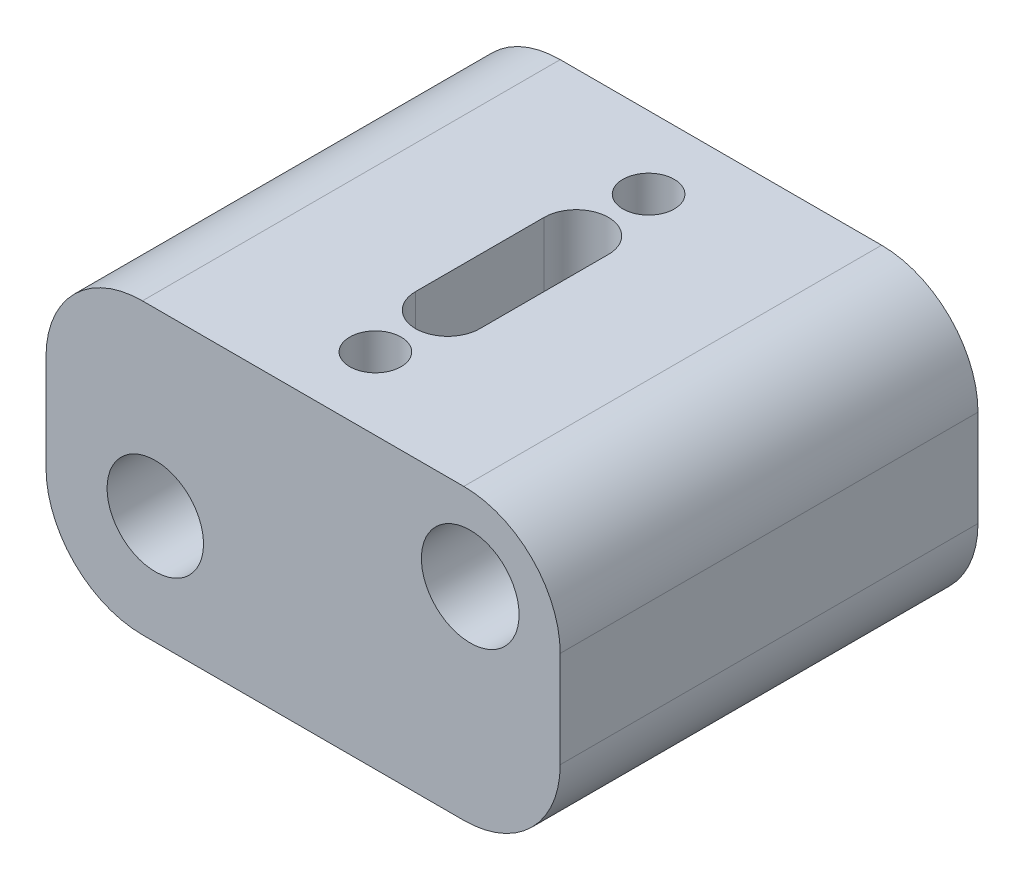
ISO-10303-21;
HEADER;
FILE_DESCRIPTION(('STEP AP214'),'2;1');
FILE_NAME('part.step','',(''),(''),'','','');
FILE_SCHEMA(('AUTOMOTIVE_DESIGN { 1 0 10303 214 1 1 1 1 }'));
ENDSEC;
DATA;
#1=APPLICATION_CONTEXT('core data for automotive mechanical design processes');
#2=APPLICATION_PROTOCOL_DEFINITION('international standard','automotive_design',2000,#1);
#3=PRODUCT_CONTEXT('',#1,'mechanical');
#4=PRODUCT('Part','Part','',(#3));
#5=PRODUCT_RELATED_PRODUCT_CATEGORY('part','',(#4));
#6=PRODUCT_DEFINITION_FORMATION('','',#4);
#7=PRODUCT_DEFINITION_CONTEXT('part definition',#1,'design');
#8=PRODUCT_DEFINITION('design','',#6,#7);
#9=PRODUCT_DEFINITION_SHAPE('','',#8);
#10=(LENGTH_UNIT() NAMED_UNIT(*) SI_UNIT(.MILLI.,.METRE.));
#11=(NAMED_UNIT(*) PLANE_ANGLE_UNIT() SI_UNIT($,.RADIAN.));
#12=(NAMED_UNIT(*) SI_UNIT($,.STERADIAN.) SOLID_ANGLE_UNIT());
#13=UNCERTAINTY_MEASURE_WITH_UNIT(LENGTH_MEASURE(1.E-05),#10,'distance_accuracy_value','');
#14=(GEOMETRIC_REPRESENTATION_CONTEXT(3) GLOBAL_UNCERTAINTY_ASSIGNED_CONTEXT((#13)) GLOBAL_UNIT_ASSIGNED_CONTEXT((#10,
#11,#12)) REPRESENTATION_CONTEXT('',''));
#15=CARTESIAN_POINT('',(0.,0.,0.));
#16=DIRECTION('',(0.,0.,1.));
#17=DIRECTION('',(1.,0.,0.));
#18=AXIS2_PLACEMENT_3D('',#15,#16,#17);
#19=CARTESIAN_POINT('',(-13.3112851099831,31.7508460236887,65.));
#20=DIRECTION('',(0.,0.,-1.));
#21=DIRECTION('',(-1.,0.,0.));
#22=AXIS2_PLACEMENT_3D('',#19,#20,#21);
#23=CYLINDRICAL_SURFACE('',#22,5.5);
#24=CARTESIAN_POINT('',(-13.3112851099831,31.7508460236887,0.));
#25=DIRECTION('',(0.,0.,-1.));
#26=DIRECTION('',(-1.,0.,0.));
#27=AXIS2_PLACEMENT_3D('',#24,#25,#26);
#28=CIRCLE('',#27,5.5);
#29=CARTESIAN_POINT('',(-18.8112851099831,31.7508460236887,0.));
#30=VERTEX_POINT('',#29);
#31=EDGE_CURVE('E370',#30,#30,#28,.T.);
#32=ORIENTED_EDGE('',*,*,#31,.T.);
#33=EDGE_LOOP('',(#32));
#34=FACE_BOUND('',#33,.T.);
#35=CARTESIAN_POINT('',(-13.3112851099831,31.7508460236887,35.));
#36=DIRECTION('',(0.,0.,1.));
#37=DIRECTION('',(1.,0.,0.));
#38=AXIS2_PLACEMENT_3D('',#35,#36,#37);
#39=CIRCLE('',#38,5.5);
#40=CARTESIAN_POINT('',(-7.81128510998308,31.7508460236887,35.));
#41=VERTEX_POINT('',#40);
#42=EDGE_CURVE('E364',#41,#41,#39,.F.);
#43=ORIENTED_EDGE('',*,*,#42,.F.);
#44=EDGE_LOOP('',(#43));
#45=FACE_BOUND('',#44,.T.);
#46=ADVANCED_FACE('F224',(#34,#45),#23,.F.);
#47=CARTESIAN_POINT('',(-79.3112851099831,44.7508460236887,65.));
#48=DIRECTION('',(1.,0.,0.));
#49=DIRECTION('',(0.,0.,-1.));
#50=AXIS2_PLACEMENT_3D('',#47,#48,#49);
#51=PLANE('',#50);
#52=DIRECTION('',(0.,-1.,0.));
#53=VECTOR('',#52,1.);
#54=CARTESIAN_POINT('',(-79.3112851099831,44.7508460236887,0.));
#55=LINE('',#54,#53);
#56=CARTESIAN_POINT('',(-79.3112851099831,29.7508460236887,0.));
#57=VERTEX_POINT('',#56);
#58=CARTESIAN_POINT('',(-79.3112851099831,14.7508460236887,0.));
#59=VERTEX_POINT('',#58);
#60=EDGE_CURVE('E377',#57,#59,#55,.T.);
#61=ORIENTED_EDGE('',*,*,#60,.T.);
#62=DIRECTION('',(0.,0.,-1.));
#63=VECTOR('',#62,1.);
#64=CARTESIAN_POINT('',(-79.3112851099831,14.7508460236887,65.));
#65=LINE('',#64,#63);
#66=CARTESIAN_POINT('',(-79.3112851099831,14.7508460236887,65.));
#67=VERTEX_POINT('',#66);
#68=EDGE_CURVE('E232',#59,#67,#65,.F.);
#69=ORIENTED_EDGE('',*,*,#68,.T.);
#70=DIRECTION('',(0.,-1.,0.));
#71=VECTOR('',#70,1.);
#72=CARTESIAN_POINT('',(-79.3112851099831,44.7508460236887,65.));
#73=LINE('',#72,#71);
#74=CARTESIAN_POINT('',(-79.3112851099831,29.7508460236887,65.));
#75=VERTEX_POINT('',#74);
#76=EDGE_CURVE('E380',#75,#67,#73,.T.);
#77=ORIENTED_EDGE('',*,*,#76,.F.);
#78=DIRECTION('',(0.,0.,-1.));
#79=VECTOR('',#78,1.);
#80=CARTESIAN_POINT('',(-79.3112851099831,29.7508460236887,65.));
#81=LINE('',#80,#79);
#82=EDGE_CURVE('E426',#75,#57,#81,.T.);
#83=ORIENTED_EDGE('',*,*,#82,.T.);
#84=EDGE_LOOP('',(#61,#69,#77,#83));
#85=FACE_BOUND('',#84,.T.);
#86=ADVANCED_FACE('F442',(#85),#51,.F.);
#87=CARTESIAN_POINT('',(-79.3112851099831,-0.249153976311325,65.));
#88=DIRECTION('',(0.,1.,0.));
#89=DIRECTION('',(0.,0.,1.));
#90=AXIS2_PLACEMENT_3D('',#87,#88,#89);
#91=PLANE('',#90);
#92=DIRECTION('',(0.,0.,1.));
#93=VECTOR('',#92,1.);
#94=CARTESIAN_POINT('',(-44.3112851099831,-0.249153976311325,42.5));
#95=LINE('',#94,#93);
#96=CARTESIAN_POINT('',(-44.3112851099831,-0.249153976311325,22.5));
#97=VERTEX_POINT('',#96);
#98=CARTESIAN_POINT('',(-44.3112851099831,-0.249153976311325,42.5));
#99=VERTEX_POINT('',#98);
#100=EDGE_CURVE('E320',#97,#99,#95,.T.);
#101=ORIENTED_EDGE('',*,*,#100,.T.);
#102=CARTESIAN_POINT('',(-39.3112851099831,-0.249153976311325,42.5));
#103=DIRECTION('',(0.,1.,0.));
#104=DIRECTION('',(0.,0.,1.));
#105=AXIS2_PLACEMENT_3D('',#102,#103,#104);
#106=CIRCLE('',#105,5.);
#107=CARTESIAN_POINT('',(-34.3112851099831,-0.249153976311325,42.5));
#108=VERTEX_POINT('',#107);
#109=EDGE_CURVE('E314',#99,#108,#106,.T.);
#110=ORIENTED_EDGE('',*,*,#109,.T.);
#111=DIRECTION('',(0.,0.,-1.));
#112=VECTOR('',#111,1.);
#113=CARTESIAN_POINT('',(-34.3112851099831,-0.249153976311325,42.5));
#114=LINE('',#113,#112);
#115=CARTESIAN_POINT('',(-34.3112851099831,-0.249153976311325,22.5));
#116=VERTEX_POINT('',#115);
#117=EDGE_CURVE('E323',#108,#116,#114,.T.);
#118=ORIENTED_EDGE('',*,*,#117,.T.);
#119=CARTESIAN_POINT('',(-39.3112851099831,-0.249153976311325,22.5));
#120=DIRECTION('',(0.,1.,0.));
#121=DIRECTION('',(0.,0.,1.));
#122=AXIS2_PLACEMENT_3D('',#119,#120,#121);
#123=CIRCLE('',#122,5.);
#124=EDGE_CURVE('E239',#116,#97,#123,.T.);
#125=ORIENTED_EDGE('',*,*,#124,.T.);
#126=EDGE_LOOP('',(#101,#110,#118,#125));
#127=FACE_BOUND('',#126,.T.);
#128=CARTESIAN_POINT('',(-39.3112851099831,-0.249153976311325,11.25));
#129=DIRECTION('',(0.,-1.,0.));
#130=DIRECTION('',(0.,0.,-1.));
#131=AXIS2_PLACEMENT_3D('',#128,#129,#130);
#132=CIRCLE('',#131,4.00000000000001);
#133=CARTESIAN_POINT('',(-39.3112851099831,-0.249153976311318,7.24999999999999));
#134=VERTEX_POINT('',#133);
#135=EDGE_CURVE('E345',#134,#134,#132,.T.);
#136=ORIENTED_EDGE('',*,*,#135,.F.);
#137=EDGE_LOOP('',(#136));
#138=FACE_BOUND('',#137,.T.);
#139=CARTESIAN_POINT('',(-39.3112851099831,-0.249153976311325,53.75));
#140=DIRECTION('',(0.,-1.,0.));
#141=DIRECTION('',(0.,0.,-1.));
#142=AXIS2_PLACEMENT_3D('',#139,#140,#141);
#143=CIRCLE('',#142,4.00000000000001);
#144=CARTESIAN_POINT('',(-39.3112851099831,-0.249153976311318,49.75));
#145=VERTEX_POINT('',#144);
#146=EDGE_CURVE('E352',#145,#145,#143,.T.);
#147=ORIENTED_EDGE('',*,*,#146,.F.);
#148=EDGE_LOOP('',(#147));
#149=FACE_BOUND('',#148,.T.);
#150=DIRECTION('',(1.,0.,0.));
#151=VECTOR('',#150,1.);
#152=CARTESIAN_POINT('',(-79.3112851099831,-0.249153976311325,65.));
#153=LINE('',#152,#151);
#154=CARTESIAN_POINT('',(-64.3112851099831,-0.249153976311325,65.));
#155=VERTEX_POINT('',#154);
#156=CARTESIAN_POINT('',(-14.3112851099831,-0.249153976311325,65.));
#157=VERTEX_POINT('',#156);
#158=EDGE_CURVE('E383',#155,#157,#153,.T.);
#159=ORIENTED_EDGE('',*,*,#158,.F.);
#160=DIRECTION('',(0.,0.,-1.));
#161=VECTOR('',#160,1.);
#162=CARTESIAN_POINT('',(-64.3112851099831,-0.249153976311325,65.));
#163=LINE('',#162,#161);
#164=CARTESIAN_POINT('',(-64.3112851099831,-0.249153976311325,0.));
#165=VERTEX_POINT('',#164);
#166=EDGE_CURVE('E435',#155,#165,#163,.T.);
#167=ORIENTED_EDGE('',*,*,#166,.T.);
#168=DIRECTION('',(1.,0.,0.));
#169=VECTOR('',#168,1.);
#170=CARTESIAN_POINT('',(-79.3112851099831,-0.249153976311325,0.));
#171=LINE('',#170,#169);
#172=CARTESIAN_POINT('',(-14.3112851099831,-0.249153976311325,0.));
#173=VERTEX_POINT('',#172);
#174=EDGE_CURVE('E395',#165,#173,#171,.T.);
#175=ORIENTED_EDGE('',*,*,#174,.T.);
#176=DIRECTION('',(0.,0.,-1.));
#177=VECTOR('',#176,1.);
#178=CARTESIAN_POINT('',(-14.3112851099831,-0.249153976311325,65.));
#179=LINE('',#178,#177);
#180=EDGE_CURVE('E412',#173,#157,#179,.F.);
#181=ORIENTED_EDGE('',*,*,#180,.T.);
#182=EDGE_LOOP('',(#159,#167,#175,#181));
#183=FACE_BOUND('',#182,.T.);
#184=ADVANCED_FACE('F327',(#127,#138,#149,#183),#91,.F.);
#185=CARTESIAN_POINT('',(0.688714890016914,44.7508460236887,65.));
#186=DIRECTION('',(-1.,0.,0.));
#187=DIRECTION('',(0.,-1.,0.));
#188=AXIS2_PLACEMENT_3D('',#185,#186,#187);
#189=PLANE('',#188);
#190=DIRECTION('',(0.,1.,0.));
#191=VECTOR('',#190,1.);
#192=CARTESIAN_POINT('',(0.688714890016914,44.7508460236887,0.));
#193=LINE('',#192,#191);
#194=CARTESIAN_POINT('',(0.688714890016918,14.7508460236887,0.));
#195=VERTEX_POINT('',#194);
#196=CARTESIAN_POINT('',(0.688714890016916,29.7508460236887,0.));
#197=VERTEX_POINT('',#196);
#198=EDGE_CURVE('E397',#195,#197,#193,.T.);
#199=ORIENTED_EDGE('',*,*,#198,.T.);
#200=DIRECTION('',(0.,0.,-1.));
#201=VECTOR('',#200,1.);
#202=CARTESIAN_POINT('',(0.688714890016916,29.7508460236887,65.));
#203=LINE('',#202,#201);
#204=CARTESIAN_POINT('',(0.688714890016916,29.7508460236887,65.));
#205=VERTEX_POINT('',#204);
#206=EDGE_CURVE('E422',#197,#205,#203,.F.);
#207=ORIENTED_EDGE('',*,*,#206,.T.);
#208=DIRECTION('',(0.,1.,0.));
#209=VECTOR('',#208,1.);
#210=CARTESIAN_POINT('',(0.688714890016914,44.7508460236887,65.));
#211=LINE('',#210,#209);
#212=CARTESIAN_POINT('',(0.688714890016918,14.7508460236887,65.));
#213=VERTEX_POINT('',#212);
#214=EDGE_CURVE('E386',#213,#205,#211,.T.);
#215=ORIENTED_EDGE('',*,*,#214,.F.);
#216=DIRECTION('',(0.,0.,-1.));
#217=VECTOR('',#216,1.);
#218=CARTESIAN_POINT('',(0.688714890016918,14.7508460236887,65.));
#219=LINE('',#218,#217);
#220=EDGE_CURVE('E404',#213,#195,#219,.T.);
#221=ORIENTED_EDGE('',*,*,#220,.T.);
#222=EDGE_LOOP('',(#199,#207,#215,#221));
#223=FACE_BOUND('',#222,.T.);
#224=ADVANCED_FACE('F465',(#223),#189,.F.);
#225=CARTESIAN_POINT('',(-79.3112851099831,44.7508460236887,65.));
#226=DIRECTION('',(0.,-1.,0.));
#227=DIRECTION('',(0.,0.,-1.));
#228=AXIS2_PLACEMENT_3D('',#225,#226,#227);
#229=PLANE('',#228);
#230=DIRECTION('',(0.,0.,-1.));
#231=VECTOR('',#230,1.);
#232=CARTESIAN_POINT('',(-34.3112851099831,44.7508460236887,42.5));
#233=LINE('',#232,#231);
#234=CARTESIAN_POINT('',(-34.3112851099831,44.7508460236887,42.5));
#235=VERTEX_POINT('',#234);
#236=CARTESIAN_POINT('',(-34.3112851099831,44.7508460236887,22.5));
#237=VERTEX_POINT('',#236);
#238=EDGE_CURVE('E339',#235,#237,#233,.T.);
#239=ORIENTED_EDGE('',*,*,#238,.F.);
#240=CARTESIAN_POINT('',(-39.3112851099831,44.7508460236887,42.5));
#241=DIRECTION('',(0.,1.,0.));
#242=DIRECTION('',(0.,0.,1.));
#243=AXIS2_PLACEMENT_3D('',#240,#241,#242);
#244=CIRCLE('',#243,5.);
#245=CARTESIAN_POINT('',(-44.3112851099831,44.7508460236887,42.5));
#246=VERTEX_POINT('',#245);
#247=EDGE_CURVE('E247',#246,#235,#244,.T.);
#248=ORIENTED_EDGE('',*,*,#247,.F.);
#249=DIRECTION('',(0.,0.,1.));
#250=VECTOR('',#249,1.);
#251=CARTESIAN_POINT('',(-44.3112851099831,44.7508460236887,42.5));
#252=LINE('',#251,#250);
#253=CARTESIAN_POINT('',(-44.3112851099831,44.7508460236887,22.5));
#254=VERTEX_POINT('',#253);
#255=EDGE_CURVE('E330',#254,#246,#252,.T.);
#256=ORIENTED_EDGE('',*,*,#255,.F.);
#257=CARTESIAN_POINT('',(-39.3112851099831,44.7508460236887,22.5));
#258=DIRECTION('',(0.,1.,0.));
#259=DIRECTION('',(0.,0.,1.));
#260=AXIS2_PLACEMENT_3D('',#257,#258,#259);
#261=CIRCLE('',#260,5.);
#262=EDGE_CURVE('E333',#237,#254,#261,.T.);
#263=ORIENTED_EDGE('',*,*,#262,.F.);
#264=EDGE_LOOP('',(#239,#248,#256,#263));
#265=FACE_BOUND('',#264,.T.);
#266=CARTESIAN_POINT('',(-39.3112851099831,44.7508460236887,11.25));
#267=DIRECTION('',(0.,-1.,0.));
#268=DIRECTION('',(0.,0.,-1.));
#269=AXIS2_PLACEMENT_3D('',#266,#267,#268);
#270=CIRCLE('',#269,4.00000000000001);
#271=CARTESIAN_POINT('',(-39.3112851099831,44.7508460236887,7.24999999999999));
#272=VERTEX_POINT('',#271);
#273=EDGE_CURVE('E349',#272,#272,#270,.T.);
#274=ORIENTED_EDGE('',*,*,#273,.T.);
#275=EDGE_LOOP('',(#274));
#276=FACE_BOUND('',#275,.T.);
#277=CARTESIAN_POINT('',(-39.3112851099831,44.7508460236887,53.75));
#278=DIRECTION('',(0.,-1.,0.));
#279=DIRECTION('',(0.,0.,-1.));
#280=AXIS2_PLACEMENT_3D('',#277,#278,#279);
#281=CIRCLE('',#280,4.00000000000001);
#282=CARTESIAN_POINT('',(-39.3112851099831,44.7508460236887,49.75));
#283=VERTEX_POINT('',#282);
#284=EDGE_CURVE('E355',#283,#283,#281,.T.);
#285=ORIENTED_EDGE('',*,*,#284,.T.);
#286=EDGE_LOOP('',(#285));
#287=FACE_BOUND('',#286,.T.);
#288=DIRECTION('',(-1.,0.,0.));
#289=VECTOR('',#288,1.);
#290=CARTESIAN_POINT('',(-79.3112851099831,44.7508460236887,0.));
#291=LINE('',#290,#289);
#292=CARTESIAN_POINT('',(-14.3112851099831,44.7508460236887,0.));
#293=VERTEX_POINT('',#292);
#294=CARTESIAN_POINT('',(-64.3112851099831,44.7508460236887,0.));
#295=VERTEX_POINT('',#294);
#296=EDGE_CURVE('E384',#293,#295,#291,.T.);
#297=ORIENTED_EDGE('',*,*,#296,.T.);
#298=DIRECTION('',(0.,0.,-1.));
#299=VECTOR('',#298,1.);
#300=CARTESIAN_POINT('',(-64.3112851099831,44.7508460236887,65.));
#301=LINE('',#300,#299);
#302=CARTESIAN_POINT('',(-64.3112851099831,44.7508460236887,65.));
#303=VERTEX_POINT('',#302);
#304=EDGE_CURVE('E431',#295,#303,#301,.F.);
#305=ORIENTED_EDGE('',*,*,#304,.T.);
#306=DIRECTION('',(-1.,0.,0.));
#307=VECTOR('',#306,1.);
#308=CARTESIAN_POINT('',(-79.3112851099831,44.7508460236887,65.));
#309=LINE('',#308,#307);
#310=CARTESIAN_POINT('',(-14.3112851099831,44.7508460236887,65.));
#311=VERTEX_POINT('',#310);
#312=EDGE_CURVE('E389',#311,#303,#309,.T.);
#313=ORIENTED_EDGE('',*,*,#312,.F.);
#314=DIRECTION('',(0.,0.,-1.));
#315=VECTOR('',#314,1.);
#316=CARTESIAN_POINT('',(-14.3112851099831,44.7508460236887,65.));
#317=LINE('',#316,#315);
#318=EDGE_CURVE('E417',#311,#293,#317,.T.);
#319=ORIENTED_EDGE('',*,*,#318,.T.);
#320=EDGE_LOOP('',(#297,#305,#313,#319));
#321=FACE_BOUND('',#320,.T.);
#322=ADVANCED_FACE('F472',(#265,#276,#287,#321),#229,.F.);
#323=CARTESIAN_POINT('',(0.,0.,65.));
#324=DIRECTION('',(0.,0.,1.));
#325=DIRECTION('',(1.,0.,0.));
#326=AXIS2_PLACEMENT_3D('',#323,#324,#325);
#327=PLANE('',#326);
#328=CARTESIAN_POINT('',(-13.3112851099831,31.7508460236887,65.));
#329=DIRECTION('',(0.,0.,1.));
#330=DIRECTION('',(1.,0.,0.));
#331=AXIS2_PLACEMENT_3D('',#328,#329,#330);
#332=CIRCLE('',#331,7.6);
#333=CARTESIAN_POINT('',(-5.71128510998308,31.7508460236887,65.));
#334=VERTEX_POINT('',#333);
#335=EDGE_CURVE('E358',#334,#334,#332,.T.);
#336=ORIENTED_EDGE('',*,*,#335,.F.);
#337=EDGE_LOOP('',(#336));
#338=FACE_BOUND('',#337,.T.);
#339=CARTESIAN_POINT('',(-62.3112851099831,16.7508460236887,65.));
#340=DIRECTION('',(0.,0.,-1.));
#341=DIRECTION('',(-1.,0.,0.));
#342=AXIS2_PLACEMENT_3D('',#339,#340,#341);
#343=CIRCLE('',#342,7.5);
#344=CARTESIAN_POINT('',(-69.8112851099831,16.7508460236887,65.));
#345=VERTEX_POINT('',#344);
#346=EDGE_CURVE('E367',#345,#345,#343,.T.);
#347=ORIENTED_EDGE('',*,*,#346,.T.);
#348=EDGE_LOOP('',(#347));
#349=FACE_BOUND('',#348,.T.);
#350=ORIENTED_EDGE('',*,*,#76,.T.);
#351=CARTESIAN_POINT('',(-64.3112851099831,14.7508460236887,65.));
#352=DIRECTION('',(0.,0.,1.));
#353=DIRECTION('',(1.,0.,0.));
#354=AXIS2_PLACEMENT_3D('',#351,#352,#353);
#355=CIRCLE('',#354,15.);
#356=EDGE_CURVE('E12',#67,#155,#355,.T.);
#357=ORIENTED_EDGE('',*,*,#356,.T.);
#358=ORIENTED_EDGE('',*,*,#158,.T.);
#359=CARTESIAN_POINT('',(-14.3112851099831,14.7508460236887,65.));
#360=DIRECTION('',(0.,0.,1.));
#361=DIRECTION('',(1.,0.,0.));
#362=AXIS2_PLACEMENT_3D('',#359,#360,#361);
#363=CIRCLE('',#362,15.);
#364=EDGE_CURVE('E415',#157,#213,#363,.T.);
#365=ORIENTED_EDGE('',*,*,#364,.T.);
#366=ORIENTED_EDGE('',*,*,#214,.T.);
#367=CARTESIAN_POINT('',(-14.3112851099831,29.7508460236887,65.));
#368=DIRECTION('',(0.,0.,1.));
#369=DIRECTION('',(1.,0.,0.));
#370=AXIS2_PLACEMENT_3D('',#367,#368,#369);
#371=CIRCLE('',#370,15.);
#372=EDGE_CURVE('E424',#205,#311,#371,.T.);
#373=ORIENTED_EDGE('',*,*,#372,.T.);
#374=ORIENTED_EDGE('',*,*,#312,.T.);
#375=CARTESIAN_POINT('',(-64.3112851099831,29.7508460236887,65.));
#376=DIRECTION('',(0.,0.,1.));
#377=DIRECTION('',(1.,0.,0.));
#378=AXIS2_PLACEMENT_3D('',#375,#376,#377);
#379=CIRCLE('',#378,15.);
#380=EDGE_CURVE('E433',#303,#75,#379,.T.);
#381=ORIENTED_EDGE('',*,*,#380,.T.);
#382=EDGE_LOOP('',(#350,#357,#358,#365,#366,#373,#374,#381));
#383=FACE_BOUND('',#382,.T.);
#384=ADVANCED_FACE('F448',(#338,#349,#383),#327,.T.);
#385=CARTESIAN_POINT('',(0.,0.,0.));
#386=DIRECTION('',(0.,0.,1.));
#387=DIRECTION('',(1.,0.,0.));
#388=AXIS2_PLACEMENT_3D('',#385,#386,#387);
#389=PLANE('',#388);
#390=ORIENTED_EDGE('',*,*,#31,.F.);
#391=EDGE_LOOP('',(#390));
#392=FACE_BOUND('',#391,.T.);
#393=CARTESIAN_POINT('',(-62.3112851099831,16.7508460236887,0.));
#394=DIRECTION('',(0.,0.,-1.));
#395=DIRECTION('',(-1.,0.,0.));
#396=AXIS2_PLACEMENT_3D('',#393,#394,#395);
#397=CIRCLE('',#396,12.8);
#398=CARTESIAN_POINT('',(-75.1112851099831,16.7508460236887,0.));
#399=VERTEX_POINT('',#398);
#400=EDGE_CURVE('E373',#399,#399,#397,.T.);
#401=ORIENTED_EDGE('',*,*,#400,.F.);
#402=EDGE_LOOP('',(#401));
#403=FACE_BOUND('',#402,.T.);
#404=ORIENTED_EDGE('',*,*,#174,.F.);
#405=CARTESIAN_POINT('',(-64.3112851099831,14.7508460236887,0.));
#406=DIRECTION('',(0.,0.,1.));
#407=DIRECTION('',(1.,0.,0.));
#408=AXIS2_PLACEMENT_3D('',#405,#406,#407);
#409=CIRCLE('',#408,15.);
#410=EDGE_CURVE('E438',#165,#59,#409,.F.);
#411=ORIENTED_EDGE('',*,*,#410,.T.);
#412=ORIENTED_EDGE('',*,*,#60,.F.);
#413=CARTESIAN_POINT('',(-64.3112851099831,29.7508460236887,0.));
#414=DIRECTION('',(0.,0.,1.));
#415=DIRECTION('',(1.,0.,0.));
#416=AXIS2_PLACEMENT_3D('',#413,#414,#415);
#417=CIRCLE('',#416,15.);
#418=EDGE_CURVE('E429',#57,#295,#417,.F.);
#419=ORIENTED_EDGE('',*,*,#418,.T.);
#420=ORIENTED_EDGE('',*,*,#296,.F.);
#421=CARTESIAN_POINT('',(-14.3112851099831,29.7508460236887,0.));
#422=DIRECTION('',(0.,0.,1.));
#423=DIRECTION('',(1.,0.,0.));
#424=AXIS2_PLACEMENT_3D('',#421,#422,#423);
#425=CIRCLE('',#424,15.);
#426=EDGE_CURVE('E420',#293,#197,#425,.F.);
#427=ORIENTED_EDGE('',*,*,#426,.T.);
#428=ORIENTED_EDGE('',*,*,#198,.F.);
#429=CARTESIAN_POINT('',(-14.3112851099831,14.7508460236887,0.));
#430=DIRECTION('',(0.,0.,1.));
#431=DIRECTION('',(1.,0.,0.));
#432=AXIS2_PLACEMENT_3D('',#429,#430,#431);
#433=CIRCLE('',#432,15.);
#434=EDGE_CURVE('E409',#195,#173,#433,.F.);
#435=ORIENTED_EDGE('',*,*,#434,.T.);
#436=EDGE_LOOP('',(#404,#411,#412,#419,#420,#427,#428,#435));
#437=FACE_BOUND('',#436,.T.);
#438=ADVANCED_FACE('F455',(#392,#403,#437),#389,.F.);
#439=CARTESIAN_POINT('',(-62.3112851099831,16.7508460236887,26.));
#440=DIRECTION('',(0.,0.,-1.));
#441=DIRECTION('',(-1.,0.,0.));
#442=AXIS2_PLACEMENT_3D('',#439,#440,#441);
#443=CYLINDRICAL_SURFACE('',#442,12.8);
#444=CARTESIAN_POINT('',(-62.3112851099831,16.7508460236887,26.));
#445=DIRECTION('',(0.,0.,-1.));
#446=DIRECTION('',(-1.,0.,0.));
#447=AXIS2_PLACEMENT_3D('',#444,#445,#446);
#448=CIRCLE('',#447,12.8);
#449=CARTESIAN_POINT('',(-75.1112851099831,16.7508460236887,26.));
#450=VERTEX_POINT('',#449);
#451=EDGE_CURVE('E374',#450,#450,#448,.T.);
#452=CARTESIAN_POINT('',(-75.1112851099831,16.7508460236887,26.));
#453=CARTESIAN_POINT('',(-75.1112851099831,16.7508460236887,25.7291666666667));
#454=CARTESIAN_POINT('',(-75.1112851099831,16.7508460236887,25.4583333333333));
#455=CARTESIAN_POINT('',(-75.1112851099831,16.7508460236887,24.9166666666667));
#456=CARTESIAN_POINT('',(-75.1112851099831,16.7508460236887,24.6458333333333));
#457=CARTESIAN_POINT('',(-75.1112851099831,16.7508460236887,24.1041666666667));
#458=CARTESIAN_POINT('',(-75.1112851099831,16.7508460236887,23.8333333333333));
#459=CARTESIAN_POINT('',(-75.1112851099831,16.7508460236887,23.2916666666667));
#460=CARTESIAN_POINT('',(-75.1112851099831,16.7508460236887,23.0208333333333));
#461=CARTESIAN_POINT('',(-75.1112851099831,16.7508460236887,22.4791666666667));
#462=CARTESIAN_POINT('',(-75.1112851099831,16.7508460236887,22.2083333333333));
#463=CARTESIAN_POINT('',(-75.1112851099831,16.7508460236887,21.6666666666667));
#464=CARTESIAN_POINT('',(-75.1112851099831,16.7508460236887,21.3958333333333));
#465=CARTESIAN_POINT('',(-75.1112851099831,16.7508460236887,20.8541666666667));
#466=CARTESIAN_POINT('',(-75.1112851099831,16.7508460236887,20.5833333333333));
#467=CARTESIAN_POINT('',(-75.1112851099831,16.7508460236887,20.0416666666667));
#468=CARTESIAN_POINT('',(-75.1112851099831,16.7508460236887,19.7708333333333));
#469=CARTESIAN_POINT('',(-75.1112851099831,16.7508460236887,19.2291666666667));
#470=CARTESIAN_POINT('',(-75.1112851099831,16.7508460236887,18.9583333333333));
#471=CARTESIAN_POINT('',(-75.1112851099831,16.7508460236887,18.4166666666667));
#472=CARTESIAN_POINT('',(-75.1112851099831,16.7508460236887,18.1458333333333));
#473=CARTESIAN_POINT('',(-75.1112851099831,16.7508460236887,17.6041666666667));
#474=CARTESIAN_POINT('',(-75.1112851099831,16.7508460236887,17.3333333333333));
#475=CARTESIAN_POINT('',(-75.1112851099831,16.7508460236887,16.7916666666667));
#476=CARTESIAN_POINT('',(-75.1112851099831,16.7508460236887,16.5208333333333));
#477=CARTESIAN_POINT('',(-75.1112851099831,16.7508460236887,15.9791666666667));
#478=CARTESIAN_POINT('',(-75.1112851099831,16.7508460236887,15.7083333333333));
#479=CARTESIAN_POINT('',(-75.1112851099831,16.7508460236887,15.1666666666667));
#480=CARTESIAN_POINT('',(-75.1112851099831,16.7508460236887,14.8958333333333));
#481=CARTESIAN_POINT('',(-75.1112851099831,16.7508460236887,14.3541666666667));
#482=CARTESIAN_POINT('',(-75.1112851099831,16.7508460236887,14.0833333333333));
#483=CARTESIAN_POINT('',(-75.1112851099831,16.7508460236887,13.5416666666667));
#484=CARTESIAN_POINT('',(-75.1112851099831,16.7508460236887,13.2708333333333));
#485=CARTESIAN_POINT('',(-75.1112851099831,16.7508460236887,12.7291666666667));
#486=CARTESIAN_POINT('',(-75.1112851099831,16.7508460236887,12.4583333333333));
#487=CARTESIAN_POINT('',(-75.1112851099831,16.7508460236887,11.9166666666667));
#488=CARTESIAN_POINT('',(-75.1112851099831,16.7508460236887,11.6458333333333));
#489=CARTESIAN_POINT('',(-75.1112851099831,16.7508460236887,11.1041666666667));
#490=CARTESIAN_POINT('',(-75.1112851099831,16.7508460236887,10.8333333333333));
#491=CARTESIAN_POINT('',(-75.1112851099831,16.7508460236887,10.2916666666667));
#492=CARTESIAN_POINT('',(-75.1112851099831,16.7508460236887,10.0208333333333));
#493=CARTESIAN_POINT('',(-75.1112851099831,16.7508460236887,9.47916666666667));
#494=CARTESIAN_POINT('',(-75.1112851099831,16.7508460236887,9.20833333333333));
#495=CARTESIAN_POINT('',(-75.1112851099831,16.7508460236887,8.66666666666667));
#496=CARTESIAN_POINT('',(-75.1112851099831,16.7508460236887,8.39583333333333));
#497=CARTESIAN_POINT('',(-75.1112851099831,16.7508460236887,7.85416666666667));
#498=CARTESIAN_POINT('',(-75.1112851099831,16.7508460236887,7.58333333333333));
#499=CARTESIAN_POINT('',(-75.1112851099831,16.7508460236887,7.04166666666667));
#500=CARTESIAN_POINT('',(-75.1112851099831,16.7508460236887,6.77083333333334));
#501=CARTESIAN_POINT('',(-75.1112851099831,16.7508460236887,6.22916666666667));
#502=CARTESIAN_POINT('',(-75.1112851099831,16.7508460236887,5.95833333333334));
#503=CARTESIAN_POINT('',(-75.1112851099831,16.7508460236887,5.41666666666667));
#504=CARTESIAN_POINT('',(-75.1112851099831,16.7508460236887,5.14583333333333));
#505=CARTESIAN_POINT('',(-75.1112851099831,16.7508460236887,4.60416666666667));
#506=CARTESIAN_POINT('',(-75.1112851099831,16.7508460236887,4.33333333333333));
#507=CARTESIAN_POINT('',(-75.1112851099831,16.7508460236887,3.79166666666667));
#508=CARTESIAN_POINT('',(-75.1112851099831,16.7508460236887,3.52083333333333));
#509=CARTESIAN_POINT('',(-75.1112851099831,16.7508460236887,2.97916666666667));
#510=CARTESIAN_POINT('',(-75.1112851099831,16.7508460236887,2.70833333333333));
#511=CARTESIAN_POINT('',(-75.1112851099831,16.7508460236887,2.16666666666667));
#512=CARTESIAN_POINT('',(-75.1112851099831,16.7508460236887,1.89583333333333));
#513=CARTESIAN_POINT('',(-75.1112851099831,16.7508460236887,1.35416666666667));
#514=CARTESIAN_POINT('',(-75.1112851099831,16.7508460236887,1.08333333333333));
#515=CARTESIAN_POINT('',(-75.1112851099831,16.7508460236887,0.541666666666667));
#516=CARTESIAN_POINT('',(-75.1112851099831,16.7508460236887,0.270833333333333));
#517=CARTESIAN_POINT('',(-75.1112851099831,16.7508460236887,0.));
#518=B_SPLINE_CURVE_WITH_KNOTS('',3,(#452,#453,#454,#455,#456,#457,#458,#459,#460,#461,#462,
#463,#464,#465,#466,#467,#468,#469,#470,#471,#472,#473,#474,#475,#476,#477,#478,#479,#480,#481,
#482,#483,#484,#485,#486,#487,#488,#489,#490,#491,#492,#493,#494,#495,#496,#497,#498,#499,#500,
#501,#502,#503,#504,#505,#506,#507,#508,#509,#510,#511,#512,#513,#514,#515,#516,#517),
.UNSPECIFIED.,.F.,.F.,(4,2,2,2,2,2,2,2,2,2,2,2,2,2,2,2,2,2,2,2,2,2,2,2,2,2,2,2,2,2,2,2,4),(0.,
0.812500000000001,1.625,2.4375,3.25,4.0625,4.875,5.6875,6.5,7.3125,8.125,8.9375,9.75,10.5625,
11.375,12.1875,13.,13.8125,14.625,15.4375,16.25,17.0625,17.875,18.6875,19.5,20.3125,21.125,
21.9375,22.75,23.5625,24.375,25.1875,26.),.UNSPECIFIED.);
#519=EDGE_CURVE('BSEAM495',#450,#399,#518,.T.);
#520=ORIENTED_EDGE('',*,*,#451,.F.);
#521=ORIENTED_EDGE('',*,*,#400,.T.);
#522=ORIENTED_EDGE('',*,*,#519,.T.);
#523=ORIENTED_EDGE('',*,*,#519,.F.);
#524=EDGE_LOOP('',(#520,#522,#521,#523));
#525=FACE_BOUND('',#524,.T.);
#526=ADVANCED_FACE('F495',(#525),#443,.F.);
#527=CARTESIAN_POINT('',(-62.3112851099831,16.7508460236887,65.));
#528=DIRECTION('',(0.,0.,-1.));
#529=DIRECTION('',(-1.,0.,0.));
#530=AXIS2_PLACEMENT_3D('',#527,#528,#529);
#531=CYLINDRICAL_SURFACE('',#530,7.5);
#532=CARTESIAN_POINT('',(-62.3112851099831,16.7508460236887,34.826664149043));
#533=DIRECTION('',(0.,0.,-1.));
#534=DIRECTION('',(-1.,0.,0.));
#535=AXIS2_PLACEMENT_3D('',#532,#533,#534);
#536=CIRCLE('',#535,7.5);
#537=CARTESIAN_POINT('',(-69.8112851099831,16.7508460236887,34.826664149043));
#538=VERTEX_POINT('',#537);
#539=EDGE_CURVE('E392',#538,#538,#536,.T.);
#540=ORIENTED_EDGE('',*,*,#539,.T.);
#541=EDGE_LOOP('',(#540));
#542=FACE_BOUND('',#541,.T.);
#543=ORIENTED_EDGE('',*,*,#346,.F.);
#544=EDGE_LOOP('',(#543));
#545=FACE_BOUND('',#544,.T.);
#546=ADVANCED_FACE('F493',(#542,#545),#531,.F.);
#547=CARTESIAN_POINT('',(-62.3112851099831,16.7508460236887,34.826664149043));
#548=DIRECTION('',(0.,0.,-1.));
#549=DIRECTION('',(-1.,0.,0.));
#550=AXIS2_PLACEMENT_3D('',#547,#548,#549);
#551=TOROIDAL_SURFACE('',#550,17.5,10.);
#552=ORIENTED_EDGE('',*,*,#451,.T.);
#553=EDGE_LOOP('',(#552));
#554=FACE_BOUND('',#553,.T.);
#555=ORIENTED_EDGE('',*,*,#539,.F.);
#556=EDGE_LOOP('',(#555));
#557=FACE_BOUND('',#556,.T.);
#558=ADVANCED_FACE('F512',(#554,#557),#551,.T.);
#559=CARTESIAN_POINT('',(-13.3112851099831,31.7508460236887,35.));
#560=DIRECTION('',(0.,0.,1.));
#561=DIRECTION('',(1.,0.,0.));
#562=AXIS2_PLACEMENT_3D('',#559,#560,#561);
#563=PLANE('',#562);
#564=CARTESIAN_POINT('',(-13.3112851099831,31.7508460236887,35.));
#565=DIRECTION('',(0.,0.,1.));
#566=DIRECTION('',(1.,0.,0.));
#567=AXIS2_PLACEMENT_3D('',#564,#565,#566);
#568=CIRCLE('',#567,7.6);
#569=CARTESIAN_POINT('',(-5.71128510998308,31.7508460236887,35.));
#570=VERTEX_POINT('',#569);
#571=EDGE_CURVE('E361',#570,#570,#568,.T.);
#572=ORIENTED_EDGE('',*,*,#571,.T.);
#573=EDGE_LOOP('',(#572));
#574=FACE_BOUND('',#573,.T.);
#575=ORIENTED_EDGE('',*,*,#42,.T.);
#576=EDGE_LOOP('',(#575));
#577=FACE_BOUND('',#576,.T.);
#578=ADVANCED_FACE('F515',(#574,#577),#563,.T.);
#579=CARTESIAN_POINT('',(-13.3112851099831,31.7508460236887,35.));
#580=DIRECTION('',(0.,0.,1.));
#581=DIRECTION('',(1.,0.,0.));
#582=AXIS2_PLACEMENT_3D('',#579,#580,#581);
#583=CYLINDRICAL_SURFACE('',#582,7.6);
#584=ORIENTED_EDGE('',*,*,#571,.F.);
#585=EDGE_LOOP('',(#584));
#586=FACE_BOUND('',#585,.T.);
#587=ORIENTED_EDGE('',*,*,#335,.T.);
#588=EDGE_LOOP('',(#587));
#589=FACE_BOUND('',#588,.T.);
#590=ADVANCED_FACE('F528',(#586,#589),#583,.F.);
#591=CARTESIAN_POINT('',(-39.3112851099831,44.7508460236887,53.75));
#592=DIRECTION('',(0.,-1.,0.));
#593=DIRECTION('',(0.,0.,-1.));
#594=AXIS2_PLACEMENT_3D('',#591,#592,#593);
#595=CYLINDRICAL_SURFACE('',#594,4.00000000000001);
#596=CARTESIAN_POINT('',(-39.3112851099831,44.7508460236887,49.75));
#597=CARTESIAN_POINT('',(-39.3112851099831,44.2820960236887,49.75));
#598=CARTESIAN_POINT('',(-39.3112851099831,43.8133460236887,49.75));
#599=CARTESIAN_POINT('',(-39.3112851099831,42.8758460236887,49.75));
#600=CARTESIAN_POINT('',(-39.3112851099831,42.4070960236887,49.75));
#601=CARTESIAN_POINT('',(-39.3112851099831,41.4695960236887,49.75));
#602=CARTESIAN_POINT('',(-39.3112851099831,41.0008460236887,49.75));
#603=CARTESIAN_POINT('',(-39.3112851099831,40.0633460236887,49.75));
#604=CARTESIAN_POINT('',(-39.3112851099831,39.5945960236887,49.75));
#605=CARTESIAN_POINT('',(-39.3112851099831,38.6570960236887,49.75));
#606=CARTESIAN_POINT('',(-39.3112851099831,38.1883460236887,49.75));
#607=CARTESIAN_POINT('',(-39.3112851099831,37.2508460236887,49.75));
#608=CARTESIAN_POINT('',(-39.3112851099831,36.7820960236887,49.75));
#609=CARTESIAN_POINT('',(-39.3112851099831,35.8445960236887,49.75));
#610=CARTESIAN_POINT('',(-39.3112851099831,35.3758460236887,49.75));
#611=CARTESIAN_POINT('',(-39.3112851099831,34.4383460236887,49.75));
#612=CARTESIAN_POINT('',(-39.3112851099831,33.9695960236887,49.75));
#613=CARTESIAN_POINT('',(-39.3112851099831,33.0320960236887,49.75));
#614=CARTESIAN_POINT('',(-39.3112851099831,32.5633460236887,49.75));
#615=CARTESIAN_POINT('',(-39.3112851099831,31.6258460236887,49.75));
#616=CARTESIAN_POINT('',(-39.3112851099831,31.1570960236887,49.75));
#617=CARTESIAN_POINT('',(-39.3112851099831,30.2195960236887,49.75));
#618=CARTESIAN_POINT('',(-39.3112851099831,29.7508460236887,49.75));
#619=CARTESIAN_POINT('',(-39.3112851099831,28.8133460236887,49.75));
#620=CARTESIAN_POINT('',(-39.3112851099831,28.3445960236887,49.75));
#621=CARTESIAN_POINT('',(-39.3112851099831,27.4070960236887,49.75));
#622=CARTESIAN_POINT('',(-39.3112851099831,26.9383460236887,49.75));
#623=CARTESIAN_POINT('',(-39.3112851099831,26.0008460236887,49.75));
#624=CARTESIAN_POINT('',(-39.3112851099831,25.5320960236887,49.75));
#625=CARTESIAN_POINT('',(-39.3112851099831,24.5945960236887,49.75));
#626=CARTESIAN_POINT('',(-39.3112851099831,24.1258460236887,49.75));
#627=CARTESIAN_POINT('',(-39.3112851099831,23.1883460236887,49.75));
#628=CARTESIAN_POINT('',(-39.3112851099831,22.7195960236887,49.75));
#629=CARTESIAN_POINT('',(-39.3112851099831,21.7820960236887,49.75));
#630=CARTESIAN_POINT('',(-39.3112851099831,21.3133460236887,49.75));
#631=CARTESIAN_POINT('',(-39.3112851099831,20.3758460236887,49.75));
#632=CARTESIAN_POINT('',(-39.3112851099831,19.9070960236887,49.75));
#633=CARTESIAN_POINT('',(-39.3112851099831,18.9695960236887,49.75));
#634=CARTESIAN_POINT('',(-39.3112851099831,18.5008460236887,49.75));
#635=CARTESIAN_POINT('',(-39.3112851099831,17.5633460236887,49.75));
#636=CARTESIAN_POINT('',(-39.3112851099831,17.0945960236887,49.75));
#637=CARTESIAN_POINT('',(-39.3112851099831,16.1570960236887,49.75));
#638=CARTESIAN_POINT('',(-39.3112851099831,15.6883460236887,49.75));
#639=CARTESIAN_POINT('',(-39.3112851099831,14.7508460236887,49.75));
#640=CARTESIAN_POINT('',(-39.3112851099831,14.2820960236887,49.75));
#641=CARTESIAN_POINT('',(-39.3112851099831,13.3445960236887,49.75));
#642=CARTESIAN_POINT('',(-39.3112851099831,12.8758460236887,49.75));
#643=CARTESIAN_POINT('',(-39.3112851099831,11.9383460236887,49.75));
#644=CARTESIAN_POINT('',(-39.3112851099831,11.4695960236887,49.75));
#645=CARTESIAN_POINT('',(-39.3112851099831,10.5320960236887,49.75));
#646=CARTESIAN_POINT('',(-39.3112851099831,10.0633460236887,49.75));
#647=CARTESIAN_POINT('',(-39.3112851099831,9.12584602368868,49.75));
#648=CARTESIAN_POINT('',(-39.3112851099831,8.65709602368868,49.75));
#649=CARTESIAN_POINT('',(-39.3112851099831,7.71959602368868,49.75));
#650=CARTESIAN_POINT('',(-39.3112851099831,7.25084602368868,49.75));
#651=CARTESIAN_POINT('',(-39.3112851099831,6.31334602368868,49.75));
#652=CARTESIAN_POINT('',(-39.3112851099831,5.84459602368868,49.75));
#653=CARTESIAN_POINT('',(-39.3112851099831,4.90709602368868,49.75));
#654=CARTESIAN_POINT('',(-39.3112851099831,4.43834602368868,49.75));
#655=CARTESIAN_POINT('',(-39.3112851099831,3.50084602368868,49.75));
#656=CARTESIAN_POINT('',(-39.3112851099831,3.03209602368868,49.75));
#657=CARTESIAN_POINT('',(-39.3112851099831,2.09459602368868,49.75));
#658=CARTESIAN_POINT('',(-39.3112851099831,1.62584602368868,49.75));
#659=CARTESIAN_POINT('',(-39.3112851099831,0.68834602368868,49.75));
#660=CARTESIAN_POINT('',(-39.3112851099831,0.219596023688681,49.75));
#661=CARTESIAN_POINT('',(-39.3112851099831,-0.249153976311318,49.75));
#662=B_SPLINE_CURVE_WITH_KNOTS('',3,(#596,#597,#598,#599,#600,#601,#602,#603,#604,#605,#606,
#607,#608,#609,#610,#611,#612,#613,#614,#615,#616,#617,#618,#619,#620,#621,#622,#623,#624,#625,
#626,#627,#628,#629,#630,#631,#632,#633,#634,#635,#636,#637,#638,#639,#640,#641,#642,#643,#644,
#645,#646,#647,#648,#649,#650,#651,#652,#653,#654,#655,#656,#657,#658,#659,#660,#661),
.UNSPECIFIED.,.F.,.F.,(4,2,2,2,2,2,2,2,2,2,2,2,2,2,2,2,2,2,2,2,2,2,2,2,2,2,2,2,2,2,2,2,4),(0.,
1.40625,2.8125,4.21874999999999,5.625,7.03125,8.43749999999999,9.84375,11.25,12.65625,14.0625,
15.46875,16.875,18.28125,19.6875,21.09375,22.5,23.90625,25.3125,26.71875,28.125,29.53125,
30.9375,32.34375,33.75,35.15625,36.5625,37.96875,39.375,40.78125,42.1875,43.59375,45.),.UNSPECIFIED.);
#663=EDGE_CURVE('BSEAM522',#283,#145,#662,.T.);
#664=ORIENTED_EDGE('',*,*,#284,.F.);
#665=ORIENTED_EDGE('',*,*,#146,.T.);
#666=ORIENTED_EDGE('',*,*,#663,.T.);
#667=ORIENTED_EDGE('',*,*,#663,.F.);
#668=EDGE_LOOP('',(#664,#666,#665,#667));
#669=FACE_BOUND('',#668,.T.);
#670=ADVANCED_FACE('F522',(#669),#595,.F.);
#671=CARTESIAN_POINT('',(-39.3112851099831,44.7508460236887,11.25));
#672=DIRECTION('',(0.,-1.,0.));
#673=DIRECTION('',(0.,0.,-1.));
#674=AXIS2_PLACEMENT_3D('',#671,#672,#673);
#675=CYLINDRICAL_SURFACE('',#674,4.00000000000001);
#676=CARTESIAN_POINT('',(-39.3112851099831,44.7508460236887,7.24999999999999));
#677=CARTESIAN_POINT('',(-39.3112851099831,44.2820960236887,7.24999999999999));
#678=CARTESIAN_POINT('',(-39.3112851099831,43.8133460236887,7.24999999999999));
#679=CARTESIAN_POINT('',(-39.3112851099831,42.8758460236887,7.24999999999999));
#680=CARTESIAN_POINT('',(-39.3112851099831,42.4070960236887,7.24999999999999));
#681=CARTESIAN_POINT('',(-39.3112851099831,41.4695960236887,7.24999999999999));
#682=CARTESIAN_POINT('',(-39.3112851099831,41.0008460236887,7.24999999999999));
#683=CARTESIAN_POINT('',(-39.3112851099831,40.0633460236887,7.24999999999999));
#684=CARTESIAN_POINT('',(-39.3112851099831,39.5945960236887,7.24999999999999));
#685=CARTESIAN_POINT('',(-39.3112851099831,38.6570960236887,7.24999999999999));
#686=CARTESIAN_POINT('',(-39.3112851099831,38.1883460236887,7.24999999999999));
#687=CARTESIAN_POINT('',(-39.3112851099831,37.2508460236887,7.24999999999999));
#688=CARTESIAN_POINT('',(-39.3112851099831,36.7820960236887,7.24999999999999));
#689=CARTESIAN_POINT('',(-39.3112851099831,35.8445960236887,7.24999999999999));
#690=CARTESIAN_POINT('',(-39.3112851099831,35.3758460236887,7.24999999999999));
#691=CARTESIAN_POINT('',(-39.3112851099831,34.4383460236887,7.24999999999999));
#692=CARTESIAN_POINT('',(-39.3112851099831,33.9695960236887,7.24999999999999));
#693=CARTESIAN_POINT('',(-39.3112851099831,33.0320960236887,7.24999999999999));
#694=CARTESIAN_POINT('',(-39.3112851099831,32.5633460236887,7.24999999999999));
#695=CARTESIAN_POINT('',(-39.3112851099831,31.6258460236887,7.24999999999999));
#696=CARTESIAN_POINT('',(-39.3112851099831,31.1570960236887,7.24999999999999));
#697=CARTESIAN_POINT('',(-39.3112851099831,30.2195960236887,7.24999999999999));
#698=CARTESIAN_POINT('',(-39.3112851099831,29.7508460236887,7.24999999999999));
#699=CARTESIAN_POINT('',(-39.3112851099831,28.8133460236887,7.24999999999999));
#700=CARTESIAN_POINT('',(-39.3112851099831,28.3445960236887,7.24999999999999));
#701=CARTESIAN_POINT('',(-39.3112851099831,27.4070960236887,7.24999999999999));
#702=CARTESIAN_POINT('',(-39.3112851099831,26.9383460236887,7.24999999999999));
#703=CARTESIAN_POINT('',(-39.3112851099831,26.0008460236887,7.24999999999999));
#704=CARTESIAN_POINT('',(-39.3112851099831,25.5320960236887,7.24999999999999));
#705=CARTESIAN_POINT('',(-39.3112851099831,24.5945960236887,7.24999999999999));
#706=CARTESIAN_POINT('',(-39.3112851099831,24.1258460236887,7.24999999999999));
#707=CARTESIAN_POINT('',(-39.3112851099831,23.1883460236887,7.24999999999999));
#708=CARTESIAN_POINT('',(-39.3112851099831,22.7195960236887,7.24999999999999));
#709=CARTESIAN_POINT('',(-39.3112851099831,21.7820960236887,7.24999999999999));
#710=CARTESIAN_POINT('',(-39.3112851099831,21.3133460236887,7.24999999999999));
#711=CARTESIAN_POINT('',(-39.3112851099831,20.3758460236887,7.24999999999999));
#712=CARTESIAN_POINT('',(-39.3112851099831,19.9070960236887,7.24999999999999));
#713=CARTESIAN_POINT('',(-39.3112851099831,18.9695960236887,7.24999999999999));
#714=CARTESIAN_POINT('',(-39.3112851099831,18.5008460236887,7.24999999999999));
#715=CARTESIAN_POINT('',(-39.3112851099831,17.5633460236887,7.24999999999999));
#716=CARTESIAN_POINT('',(-39.3112851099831,17.0945960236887,7.24999999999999));
#717=CARTESIAN_POINT('',(-39.3112851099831,16.1570960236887,7.24999999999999));
#718=CARTESIAN_POINT('',(-39.3112851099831,15.6883460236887,7.24999999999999));
#719=CARTESIAN_POINT('',(-39.3112851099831,14.7508460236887,7.24999999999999));
#720=CARTESIAN_POINT('',(-39.3112851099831,14.2820960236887,7.24999999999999));
#721=CARTESIAN_POINT('',(-39.3112851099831,13.3445960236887,7.24999999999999));
#722=CARTESIAN_POINT('',(-39.3112851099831,12.8758460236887,7.24999999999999));
#723=CARTESIAN_POINT('',(-39.3112851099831,11.9383460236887,7.24999999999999));
#724=CARTESIAN_POINT('',(-39.3112851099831,11.4695960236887,7.24999999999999));
#725=CARTESIAN_POINT('',(-39.3112851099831,10.5320960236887,7.24999999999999));
#726=CARTESIAN_POINT('',(-39.3112851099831,10.0633460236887,7.24999999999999));
#727=CARTESIAN_POINT('',(-39.3112851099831,9.12584602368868,7.24999999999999));
#728=CARTESIAN_POINT('',(-39.3112851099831,8.65709602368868,7.24999999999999));
#729=CARTESIAN_POINT('',(-39.3112851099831,7.71959602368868,7.24999999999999));
#730=CARTESIAN_POINT('',(-39.3112851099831,7.25084602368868,7.24999999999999));
#731=CARTESIAN_POINT('',(-39.3112851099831,6.31334602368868,7.24999999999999));
#732=CARTESIAN_POINT('',(-39.3112851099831,5.84459602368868,7.24999999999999));
#733=CARTESIAN_POINT('',(-39.3112851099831,4.90709602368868,7.24999999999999));
#734=CARTESIAN_POINT('',(-39.3112851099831,4.43834602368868,7.24999999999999));
#735=CARTESIAN_POINT('',(-39.3112851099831,3.50084602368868,7.24999999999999));
#736=CARTESIAN_POINT('',(-39.3112851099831,3.03209602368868,7.24999999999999));
#737=CARTESIAN_POINT('',(-39.3112851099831,2.09459602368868,7.24999999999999));
#738=CARTESIAN_POINT('',(-39.3112851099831,1.62584602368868,7.24999999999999));
#739=CARTESIAN_POINT('',(-39.3112851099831,0.68834602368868,7.24999999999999));
#740=CARTESIAN_POINT('',(-39.3112851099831,0.219596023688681,7.24999999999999));
#741=CARTESIAN_POINT('',(-39.3112851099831,-0.249153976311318,7.24999999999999));
#742=B_SPLINE_CURVE_WITH_KNOTS('',3,(#676,#677,#678,#679,#680,#681,#682,#683,#684,#685,#686,
#687,#688,#689,#690,#691,#692,#693,#694,#695,#696,#697,#698,#699,#700,#701,#702,#703,#704,#705,
#706,#707,#708,#709,#710,#711,#712,#713,#714,#715,#716,#717,#718,#719,#720,#721,#722,#723,#724,
#725,#726,#727,#728,#729,#730,#731,#732,#733,#734,#735,#736,#737,#738,#739,#740,#741),
.UNSPECIFIED.,.F.,.F.,(4,2,2,2,2,2,2,2,2,2,2,2,2,2,2,2,2,2,2,2,2,2,2,2,2,2,2,2,2,2,2,2,4),(0.,
1.40625,2.8125,4.21874999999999,5.625,7.03125,8.43749999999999,9.84375,11.25,12.65625,14.0625,
15.46875,16.875,18.28125,19.6875,21.09375,22.5,23.90625,25.3125,26.71875,28.125,29.53125,
30.9375,32.34375,33.75,35.15625,36.5625,37.96875,39.375,40.78125,42.1875,43.59375,45.),.UNSPECIFIED.);
#743=EDGE_CURVE('BSEAM518',#272,#134,#742,.T.);
#744=ORIENTED_EDGE('',*,*,#273,.F.);
#745=ORIENTED_EDGE('',*,*,#135,.T.);
#746=ORIENTED_EDGE('',*,*,#743,.T.);
#747=ORIENTED_EDGE('',*,*,#743,.F.);
#748=EDGE_LOOP('',(#744,#746,#745,#747));
#749=FACE_BOUND('',#748,.T.);
#750=ADVANCED_FACE('F518',(#749),#675,.F.);
#751=CARTESIAN_POINT('',(-14.3112851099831,14.7508460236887,65.));
#752=DIRECTION('',(0.,0.,-1.));
#753=DIRECTION('',(-1.,0.,0.));
#754=AXIS2_PLACEMENT_3D('',#751,#752,#753);
#755=CYLINDRICAL_SURFACE('',#754,15.);
#756=ORIENTED_EDGE('',*,*,#364,.F.);
#757=ORIENTED_EDGE('',*,*,#180,.F.);
#758=ORIENTED_EDGE('',*,*,#434,.F.);
#759=ORIENTED_EDGE('',*,*,#220,.F.);
#760=EDGE_LOOP('',(#756,#757,#758,#759));
#761=FACE_BOUND('',#760,.T.);
#762=ADVANCED_FACE('F461',(#761),#755,.T.);
#763=CARTESIAN_POINT('',(-14.3112851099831,29.7508460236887,65.));
#764=DIRECTION('',(0.,0.,-1.));
#765=DIRECTION('',(-1.,0.,0.));
#766=AXIS2_PLACEMENT_3D('',#763,#764,#765);
#767=CYLINDRICAL_SURFACE('',#766,15.);
#768=ORIENTED_EDGE('',*,*,#372,.F.);
#769=ORIENTED_EDGE('',*,*,#206,.F.);
#770=ORIENTED_EDGE('',*,*,#426,.F.);
#771=ORIENTED_EDGE('',*,*,#318,.F.);
#772=EDGE_LOOP('',(#768,#769,#770,#771));
#773=FACE_BOUND('',#772,.T.);
#774=ADVANCED_FACE('F468',(#773),#767,.T.);
#775=CARTESIAN_POINT('',(-64.3112851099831,29.7508460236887,65.));
#776=DIRECTION('',(0.,0.,-1.));
#777=DIRECTION('',(-1.,0.,0.));
#778=AXIS2_PLACEMENT_3D('',#775,#776,#777);
#779=CYLINDRICAL_SURFACE('',#778,15.);
#780=ORIENTED_EDGE('',*,*,#380,.F.);
#781=ORIENTED_EDGE('',*,*,#304,.F.);
#782=ORIENTED_EDGE('',*,*,#418,.F.);
#783=ORIENTED_EDGE('',*,*,#82,.F.);
#784=EDGE_LOOP('',(#780,#781,#782,#783));
#785=FACE_BOUND('',#784,.T.);
#786=ADVANCED_FACE('F476',(#785),#779,.T.);
#787=CARTESIAN_POINT('',(-64.3112851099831,14.7508460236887,65.));
#788=DIRECTION('',(0.,0.,-1.));
#789=DIRECTION('',(-1.,0.,0.));
#790=AXIS2_PLACEMENT_3D('',#787,#788,#789);
#791=CYLINDRICAL_SURFACE('',#790,15.);
#792=ORIENTED_EDGE('',*,*,#356,.F.);
#793=ORIENTED_EDGE('',*,*,#68,.F.);
#794=ORIENTED_EDGE('',*,*,#410,.F.);
#795=ORIENTED_EDGE('',*,*,#166,.F.);
#796=EDGE_LOOP('',(#792,#793,#794,#795));
#797=FACE_BOUND('',#796,.T.);
#798=ADVANCED_FACE('F226',(#797),#791,.T.);
#799=CARTESIAN_POINT('',(-39.3112851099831,-0.249153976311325,42.5));
#800=DIRECTION('',(0.,1.,0.));
#801=DIRECTION('',(0.,0.,1.));
#802=AXIS2_PLACEMENT_3D('',#799,#800,#801);
#803=CYLINDRICAL_SURFACE('',#802,5.);
#804=ORIENTED_EDGE('',*,*,#247,.T.);
#805=DIRECTION('',(0.,1.,0.));
#806=VECTOR('',#805,1.);
#807=CARTESIAN_POINT('',(-34.3112851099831,-0.249153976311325,42.5));
#808=LINE('',#807,#806);
#809=EDGE_CURVE('E310',#108,#235,#808,.T.);
#810=ORIENTED_EDGE('',*,*,#809,.F.);
#811=ORIENTED_EDGE('',*,*,#109,.F.);
#812=DIRECTION('',(0.,1.,0.));
#813=VECTOR('',#812,1.);
#814=CARTESIAN_POINT('',(-44.3112851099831,-0.249153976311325,42.5));
#815=LINE('',#814,#813);
#816=EDGE_CURVE('E343',#99,#246,#815,.T.);
#817=ORIENTED_EDGE('',*,*,#816,.T.);
#818=EDGE_LOOP('',(#804,#810,#811,#817));
#819=FACE_BOUND('',#818,.T.);
#820=ADVANCED_FACE('F312',(#819),#803,.F.);
#821=CARTESIAN_POINT('',(-44.3112851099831,-0.249153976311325,42.5));
#822=DIRECTION('',(-1.,0.,0.));
#823=DIRECTION('',(0.,0.,1.));
#824=AXIS2_PLACEMENT_3D('',#821,#822,#823);
#825=PLANE('',#824);
#826=ORIENTED_EDGE('',*,*,#255,.T.);
#827=ORIENTED_EDGE('',*,*,#816,.F.);
#828=ORIENTED_EDGE('',*,*,#100,.F.);
#829=DIRECTION('',(0.,1.,0.));
#830=VECTOR('',#829,1.);
#831=CARTESIAN_POINT('',(-44.3112851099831,-0.249153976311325,22.5));
#832=LINE('',#831,#830);
#833=EDGE_CURVE('E346',#97,#254,#832,.T.);
#834=ORIENTED_EDGE('',*,*,#833,.T.);
#835=EDGE_LOOP('',(#826,#827,#828,#834));
#836=FACE_BOUND('',#835,.T.);
#837=ADVANCED_FACE('F646',(#836),#825,.F.);
#838=CARTESIAN_POINT('',(-39.3112851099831,-0.249153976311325,22.5));
#839=DIRECTION('',(0.,1.,0.));
#840=DIRECTION('',(0.,0.,1.));
#841=AXIS2_PLACEMENT_3D('',#838,#839,#840);
#842=CYLINDRICAL_SURFACE('',#841,5.);
#843=ORIENTED_EDGE('',*,*,#262,.T.);
#844=ORIENTED_EDGE('',*,*,#833,.F.);
#845=ORIENTED_EDGE('',*,*,#124,.F.);
#846=DIRECTION('',(0.,1.,0.));
#847=VECTOR('',#846,1.);
#848=CARTESIAN_POINT('',(-34.3112851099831,-0.249153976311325,22.5));
#849=LINE('',#848,#847);
#850=EDGE_CURVE('E319',#116,#237,#849,.T.);
#851=ORIENTED_EDGE('',*,*,#850,.T.);
#852=EDGE_LOOP('',(#843,#844,#845,#851));
#853=FACE_BOUND('',#852,.T.);
#854=ADVANCED_FACE('F654',(#853),#842,.F.);
#855=CARTESIAN_POINT('',(-34.3112851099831,-0.249153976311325,42.5));
#856=DIRECTION('',(1.,0.,0.));
#857=DIRECTION('',(0.,0.,-1.));
#858=AXIS2_PLACEMENT_3D('',#855,#856,#857);
#859=PLANE('',#858);
#860=ORIENTED_EDGE('',*,*,#238,.T.);
#861=ORIENTED_EDGE('',*,*,#850,.F.);
#862=ORIENTED_EDGE('',*,*,#117,.F.);
#863=ORIENTED_EDGE('',*,*,#809,.T.);
#864=EDGE_LOOP('',(#860,#861,#862,#863));
#865=FACE_BOUND('',#864,.T.);
#866=ADVANCED_FACE('F324',(#865),#859,.F.);
#867=CLOSED_SHELL('',(#46,#86,#184,#224,#322,#384,#438,#526,#546,#558,#578,#590,#670,#750,#762,
#774,#786,#798,#820,#837,#854,#866));
#868=MANIFOLD_SOLID_BREP('B2',#867);
#869=ADVANCED_BREP_SHAPE_REPRESENTATION('',(#18,#868),#14);
#870=SHAPE_DEFINITION_REPRESENTATION(#9,#869);
ENDSEC;
END-ISO-10303-21;
